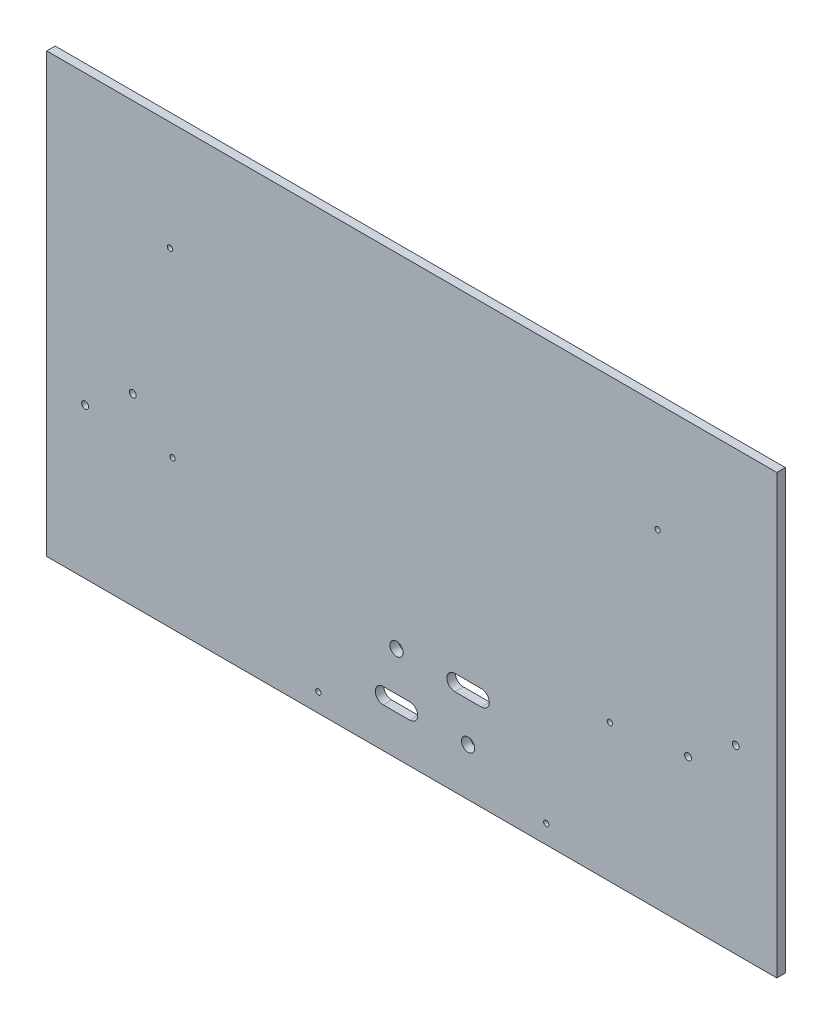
ISO-10303-21;
HEADER;
FILE_DESCRIPTION(('STEP AP214'),'2;1');
FILE_NAME('part.step','',(''),(''),'','','');
FILE_SCHEMA(('AUTOMOTIVE_DESIGN { 1 0 10303 214 1 1 1 1 }'));
ENDSEC;
DATA;
#1=APPLICATION_CONTEXT('core data for automotive mechanical design processes');
#2=APPLICATION_PROTOCOL_DEFINITION('international standard','automotive_design',2000,#1);
#3=PRODUCT_CONTEXT('',#1,'mechanical');
#4=PRODUCT('Part','Part','',(#3));
#5=PRODUCT_RELATED_PRODUCT_CATEGORY('part','',(#4));
#6=PRODUCT_DEFINITION_FORMATION('','',#4);
#7=PRODUCT_DEFINITION_CONTEXT('part definition',#1,'design');
#8=PRODUCT_DEFINITION('design','',#6,#7);
#9=PRODUCT_DEFINITION_SHAPE('','',#8);
#10=(LENGTH_UNIT() NAMED_UNIT(*) SI_UNIT(.MILLI.,.METRE.));
#11=(NAMED_UNIT(*) PLANE_ANGLE_UNIT() SI_UNIT($,.RADIAN.));
#12=(NAMED_UNIT(*) SI_UNIT($,.STERADIAN.) SOLID_ANGLE_UNIT());
#13=UNCERTAINTY_MEASURE_WITH_UNIT(LENGTH_MEASURE(1.E-05),#10,'distance_accuracy_value','');
#14=(GEOMETRIC_REPRESENTATION_CONTEXT(3) GLOBAL_UNCERTAINTY_ASSIGNED_CONTEXT((#13)) GLOBAL_UNIT_ASSIGNED_CONTEXT((#10,
#11,#12)) REPRESENTATION_CONTEXT('',''));
#15=CARTESIAN_POINT('',(0.,0.,0.));
#16=DIRECTION('',(0.,0.,1.));
#17=DIRECTION('',(1.,0.,0.));
#18=AXIS2_PLACEMENT_3D('',#15,#16,#17);
#19=CARTESIAN_POINT('',(0.,0.,1.6));
#20=DIRECTION('',(0.,0.,1.));
#21=DIRECTION('',(1.,0.,0.));
#22=AXIS2_PLACEMENT_3D('',#19,#20,#21);
#23=PLANE('',#22);
#24=CARTESIAN_POINT('',(133.5,-46.,1.6));
#25=DIRECTION('',(0.,0.,-1.));
#26=DIRECTION('',(-1.,0.,0.));
#27=AXIS2_PLACEMENT_3D('',#24,#25,#26);
#28=CIRCLE('',#27,0.5);
#29=CARTESIAN_POINT('',(133.,-46.,1.6));
#30=VERTEX_POINT('',#29);
#31=EDGE_CURVE('E161',#30,#30,#28,.T.);
#32=ORIENTED_EDGE('',*,*,#31,.T.);
#33=EDGE_LOOP('',(#32));
#34=FACE_BOUND('',#33,.T.);
#35=CARTESIAN_POINT('',(148.24899,-73.862798,1.6));
#36=DIRECTION('',(0.,0.,-1.));
#37=DIRECTION('',(-1.,0.,0.));
#38=AXIS2_PLACEMENT_3D('',#35,#36,#37);
#39=CIRCLE('',#38,0.6477);
#40=CARTESIAN_POINT('',(147.60129,-73.862798,1.6));
#41=VERTEX_POINT('',#40);
#42=EDGE_CURVE('E165',#41,#41,#39,.T.);
#43=ORIENTED_EDGE('',*,*,#42,.T.);
#44=EDGE_LOOP('',(#43));
#45=FACE_BOUND('',#44,.T.);
#46=CARTESIAN_POINT('',(41.5,-46.,1.6));
#47=DIRECTION('',(0.,0.,-1.));
#48=DIRECTION('',(-1.,0.,0.));
#49=AXIS2_PLACEMENT_3D('',#46,#47,#48);
#50=CIRCLE('',#49,0.5);
#51=CARTESIAN_POINT('',(41.,-46.,1.6));
#52=VERTEX_POINT('',#51);
#53=EDGE_CURVE('E168',#52,#52,#50,.T.);
#54=ORIENTED_EDGE('',*,*,#53,.T.);
#55=EDGE_LOOP('',(#54));
#56=FACE_BOUND('',#55,.T.);
#57=CARTESIAN_POINT('',(34.5,-73.287202,1.6));
#58=DIRECTION('',(0.,0.,-1.));
#59=DIRECTION('',(-1.,0.,0.));
#60=AXIS2_PLACEMENT_3D('',#57,#58,#59);
#61=CIRCLE('',#60,0.6477);
#62=CARTESIAN_POINT('',(33.8523,-73.287202,1.6));
#63=VERTEX_POINT('',#62);
#64=EDGE_CURVE('E171',#63,#63,#61,.T.);
#65=ORIENTED_EDGE('',*,*,#64,.T.);
#66=EDGE_LOOP('',(#65));
#67=FACE_BOUND('',#66,.T.);
#68=CARTESIAN_POINT('',(139.249008,-80.212798,1.6));
#69=DIRECTION('',(0.,0.,-1.));
#70=DIRECTION('',(-1.,0.,0.));
#71=AXIS2_PLACEMENT_3D('',#68,#69,#70);
#72=CIRCLE('',#71,0.6477);
#73=CARTESIAN_POINT('',(138.601308,-80.212798,1.6));
#74=VERTEX_POINT('',#73);
#75=EDGE_CURVE('E174',#74,#74,#72,.T.);
#76=ORIENTED_EDGE('',*,*,#75,.T.);
#77=EDGE_LOOP('',(#76));
#78=FACE_BOUND('',#77,.T.);
#79=CARTESIAN_POINT('',(124.5,-82.,1.6));
#80=DIRECTION('',(0.,0.,-1.));
#81=DIRECTION('',(-1.,0.,0.));
#82=AXIS2_PLACEMENT_3D('',#79,#80,#81);
#83=CIRCLE('',#82,0.5);
#84=CARTESIAN_POINT('',(124.,-82.,1.6));
#85=VERTEX_POINT('',#84);
#86=EDGE_CURVE('E177',#85,#85,#83,.T.);
#87=ORIENTED_EDGE('',*,*,#86,.T.);
#88=EDGE_LOOP('',(#87));
#89=FACE_BOUND('',#88,.T.);
#90=CARTESIAN_POINT('',(95.25,-90.1,1.6));
#91=DIRECTION('',(0.,0.,-1.));
#92=DIRECTION('',(-1.,0.,0.));
#93=AXIS2_PLACEMENT_3D('',#90,#91,#92);
#94=CIRCLE('',#93,1.5);
#95=CARTESIAN_POINT('',(95.25,-91.6,1.6));
#96=VERTEX_POINT('',#95);
#97=CARTESIAN_POINT('',(95.25,-88.6,1.6));
#98=VERTEX_POINT('',#97);
#99=EDGE_CURVE('E180',#96,#98,#94,.T.);
#100=ORIENTED_EDGE('',*,*,#99,.T.);
#101=DIRECTION('',(1.,0.,0.));
#102=VECTOR('',#101,1.);
#103=CARTESIAN_POINT('',(100.25,-88.6,1.6));
#104=LINE('',#103,#102);
#105=CARTESIAN_POINT('',(100.25,-88.6,1.6));
#106=VERTEX_POINT('',#105);
#107=EDGE_CURVE('E232',#106,#98,#104,.F.);
#108=ORIENTED_EDGE('',*,*,#107,.F.);
#109=CARTESIAN_POINT('',(100.25,-90.1,1.6));
#110=DIRECTION('',(0.,0.,-1.));
#111=DIRECTION('',(-1.,0.,0.));
#112=AXIS2_PLACEMENT_3D('',#109,#110,#111);
#113=CIRCLE('',#112,1.5);
#114=CARTESIAN_POINT('',(100.25,-91.6,1.6));
#115=VERTEX_POINT('',#114);
#116=EDGE_CURVE('E185',#106,#115,#113,.T.);
#117=ORIENTED_EDGE('',*,*,#116,.T.);
#118=DIRECTION('',(1.,0.,0.));
#119=VECTOR('',#118,1.);
#120=CARTESIAN_POINT('',(95.25,-91.6,1.6));
#121=LINE('',#120,#119);
#122=EDGE_CURVE('E110',#96,#115,#121,.T.);
#123=ORIENTED_EDGE('',*,*,#122,.F.);
#124=EDGE_LOOP('',(#100,#108,#117,#123));
#125=FACE_BOUND('',#124,.T.);
#126=CARTESIAN_POINT('',(112.5,-104.5,1.6));
#127=DIRECTION('',(0.,0.,-1.));
#128=DIRECTION('',(-1.,0.,0.));
#129=AXIS2_PLACEMENT_3D('',#126,#127,#128);
#130=CIRCLE('',#129,0.5);
#131=CARTESIAN_POINT('',(112.,-104.5,1.6));
#132=VERTEX_POINT('',#131);
#133=EDGE_CURVE('E188',#132,#132,#130,.T.);
#134=ORIENTED_EDGE('',*,*,#133,.T.);
#135=EDGE_LOOP('',(#134));
#136=FACE_BOUND('',#135,.T.);
#137=CARTESIAN_POINT('',(97.75,-99.,1.6));
#138=DIRECTION('',(0.,0.,-1.));
#139=DIRECTION('',(-1.,0.,0.));
#140=AXIS2_PLACEMENT_3D('',#137,#138,#139);
#141=CIRCLE('',#140,1.25);
#142=CARTESIAN_POINT('',(96.5,-99.,1.6));
#143=VERTEX_POINT('',#142);
#144=EDGE_CURVE('E191',#143,#143,#141,.T.);
#145=ORIENTED_EDGE('',*,*,#144,.T.);
#146=EDGE_LOOP('',(#145));
#147=FACE_BOUND('',#146,.T.);
#148=CARTESIAN_POINT('',(84.25,-90.1,1.6));
#149=DIRECTION('',(0.,0.,-1.));
#150=DIRECTION('',(-1.,0.,0.));
#151=AXIS2_PLACEMENT_3D('',#148,#149,#150);
#152=CIRCLE('',#151,1.25);
#153=CARTESIAN_POINT('',(83.,-90.1,1.6));
#154=VERTEX_POINT('',#153);
#155=EDGE_CURVE('E194',#154,#154,#152,.T.);
#156=ORIENTED_EDGE('',*,*,#155,.T.);
#157=EDGE_LOOP('',(#156));
#158=FACE_BOUND('',#157,.T.);
#159=CARTESIAN_POINT('',(42.,-80.,1.6));
#160=DIRECTION('',(0.,0.,-1.));
#161=DIRECTION('',(-1.,0.,0.));
#162=AXIS2_PLACEMENT_3D('',#159,#160,#161);
#163=CIRCLE('',#162,0.5);
#164=CARTESIAN_POINT('',(41.5,-80.,1.6));
#165=VERTEX_POINT('',#164);
#166=EDGE_CURVE('E197',#165,#165,#163,.T.);
#167=ORIENTED_EDGE('',*,*,#166,.T.);
#168=EDGE_LOOP('',(#167));
#169=FACE_BOUND('',#168,.T.);
#170=CARTESIAN_POINT('',(25.500018,-79.637202,1.6));
#171=DIRECTION('',(0.,0.,-1.));
#172=DIRECTION('',(-1.,0.,0.));
#173=AXIS2_PLACEMENT_3D('',#170,#171,#172);
#174=CIRCLE('',#173,0.6477);
#175=CARTESIAN_POINT('',(24.852318,-79.637202,1.6));
#176=VERTEX_POINT('',#175);
#177=EDGE_CURVE('E106',#176,#176,#174,.T.);
#178=ORIENTED_EDGE('',*,*,#177,.T.);
#179=EDGE_LOOP('',(#178));
#180=FACE_BOUND('',#179,.T.);
#181=CARTESIAN_POINT('',(81.75,-99.,1.6));
#182=DIRECTION('',(0.,0.,-1.));
#183=DIRECTION('',(-1.,0.,0.));
#184=AXIS2_PLACEMENT_3D('',#181,#182,#183);
#185=CIRCLE('',#184,1.5);
#186=CARTESIAN_POINT('',(81.75,-100.5,1.6));
#187=VERTEX_POINT('',#186);
#188=CARTESIAN_POINT('',(81.75,-97.5,1.6));
#189=VERTEX_POINT('',#188);
#190=EDGE_CURVE('E99',#187,#189,#185,.T.);
#191=ORIENTED_EDGE('',*,*,#190,.T.);
#192=DIRECTION('',(1.,0.,0.));
#193=VECTOR('',#192,1.);
#194=CARTESIAN_POINT('',(86.75,-97.5,1.6));
#195=LINE('',#194,#193);
#196=CARTESIAN_POINT('',(86.75,-97.5,1.6));
#197=VERTEX_POINT('',#196);
#198=EDGE_CURVE('E95',#197,#189,#195,.F.);
#199=ORIENTED_EDGE('',*,*,#198,.F.);
#200=CARTESIAN_POINT('',(86.75,-99.,1.6));
#201=DIRECTION('',(0.,0.,-1.));
#202=DIRECTION('',(-1.,0.,0.));
#203=AXIS2_PLACEMENT_3D('',#200,#201,#202);
#204=CIRCLE('',#203,1.5);
#205=CARTESIAN_POINT('',(86.75,-100.5,1.6));
#206=VERTEX_POINT('',#205);
#207=EDGE_CURVE('E83',#197,#206,#204,.T.);
#208=ORIENTED_EDGE('',*,*,#207,.T.);
#209=DIRECTION('',(1.,0.,0.));
#210=VECTOR('',#209,1.);
#211=CARTESIAN_POINT('',(81.75,-100.5,1.6));
#212=LINE('',#211,#210);
#213=EDGE_CURVE('E92',#187,#206,#212,.T.);
#214=ORIENTED_EDGE('',*,*,#213,.F.);
#215=EDGE_LOOP('',(#191,#199,#208,#214));
#216=FACE_BOUND('',#215,.T.);
#217=CARTESIAN_POINT('',(69.5,-104.5,1.6));
#218=DIRECTION('',(0.,0.,-1.));
#219=DIRECTION('',(-1.,0.,0.));
#220=AXIS2_PLACEMENT_3D('',#217,#218,#219);
#221=CIRCLE('',#220,0.5);
#222=CARTESIAN_POINT('',(69.,-104.5,1.6));
#223=VERTEX_POINT('',#222);
#224=EDGE_CURVE('E20',#223,#223,#221,.T.);
#225=ORIENTED_EDGE('',*,*,#224,.T.);
#226=EDGE_LOOP('',(#225));
#227=FACE_BOUND('',#226,.T.);
#228=DIRECTION('',(1.,0.,0.));
#229=VECTOR('',#228,1.);
#230=CARTESIAN_POINT('',(18.25,-25.4,1.6));
#231=LINE('',#230,#229);
#232=CARTESIAN_POINT('',(18.25,-25.4,1.6));
#233=VERTEX_POINT('',#232);
#234=CARTESIAN_POINT('',(156.,-25.4,1.6));
#235=VERTEX_POINT('',#234);
#236=EDGE_CURVE('E221',#233,#235,#231,.T.);
#237=ORIENTED_EDGE('',*,*,#236,.F.);
#238=DIRECTION('',(0.,1.,0.));
#239=VECTOR('',#238,1.);
#240=CARTESIAN_POINT('',(18.25,-108.,1.6));
#241=LINE('',#240,#239);
#242=CARTESIAN_POINT('',(18.25,-108.,1.6));
#243=VERTEX_POINT('',#242);
#244=EDGE_CURVE('E212',#243,#233,#241,.T.);
#245=ORIENTED_EDGE('',*,*,#244,.F.);
#246=DIRECTION('',(1.,0.,0.));
#247=VECTOR('',#246,1.);
#248=CARTESIAN_POINT('',(156.,-108.,1.6));
#249=LINE('',#248,#247);
#250=CARTESIAN_POINT('',(156.,-108.,1.6));
#251=VERTEX_POINT('',#250);
#252=EDGE_CURVE('E230',#251,#243,#249,.F.);
#253=ORIENTED_EDGE('',*,*,#252,.F.);
#254=DIRECTION('',(0.,1.,0.));
#255=VECTOR('',#254,1.);
#256=CARTESIAN_POINT('',(156.,-25.4,1.6));
#257=LINE('',#256,#255);
#258=EDGE_CURVE('E227',#235,#251,#257,.F.);
#259=ORIENTED_EDGE('',*,*,#258,.F.);
#260=EDGE_LOOP('',(#237,#245,#253,#259));
#261=FACE_BOUND('',#260,.T.);
#262=ADVANCED_FACE('F17',(#34,#45,#56,#67,#78,#89,#125,#136,#147,#158,#169,#180,#216,#227,#261),
#23,.T.);
#263=CARTESIAN_POINT('',(156.,-108.,0.));
#264=DIRECTION('',(0.,-1.,0.));
#265=DIRECTION('',(0.,0.,-1.));
#266=AXIS2_PLACEMENT_3D('',#263,#264,#265);
#267=PLANE('',#266);
#268=DIRECTION('',(0.,0.,1.));
#269=VECTOR('',#268,1.);
#270=CARTESIAN_POINT('',(18.25,-108.,0.));
#271=LINE('',#270,#269);
#272=CARTESIAN_POINT('',(18.25,-108.,0.));
#273=VERTEX_POINT('',#272);
#274=EDGE_CURVE('E215',#273,#243,#271,.T.);
#275=ORIENTED_EDGE('',*,*,#274,.F.);
#276=DIRECTION('',(1.,0.,0.));
#277=VECTOR('',#276,1.);
#278=CARTESIAN_POINT('',(0.,-108.,0.));
#279=LINE('',#278,#277);
#280=CARTESIAN_POINT('',(156.,-108.,0.));
#281=VERTEX_POINT('',#280);
#282=EDGE_CURVE('E164',#273,#281,#279,.T.);
#283=ORIENTED_EDGE('',*,*,#282,.T.);
#284=DIRECTION('',(0.,0.,-1.));
#285=VECTOR('',#284,1.);
#286=CARTESIAN_POINT('',(156.,-108.,0.));
#287=LINE('',#286,#285);
#288=EDGE_CURVE('E224',#251,#281,#287,.T.);
#289=ORIENTED_EDGE('',*,*,#288,.F.);
#290=ORIENTED_EDGE('',*,*,#252,.T.);
#291=EDGE_LOOP('',(#275,#283,#289,#290));
#292=FACE_BOUND('',#291,.T.);
#293=ADVANCED_FACE('F275',(#292),#267,.T.);
#294=CARTESIAN_POINT('',(156.,-25.4,0.));
#295=DIRECTION('',(1.,0.,0.));
#296=DIRECTION('',(0.,0.,-1.));
#297=AXIS2_PLACEMENT_3D('',#294,#295,#296);
#298=PLANE('',#297);
#299=ORIENTED_EDGE('',*,*,#288,.T.);
#300=DIRECTION('',(0.,1.,0.));
#301=VECTOR('',#300,1.);
#302=CARTESIAN_POINT('',(156.,0.,0.));
#303=LINE('',#302,#301);
#304=CARTESIAN_POINT('',(156.,-25.4,0.));
#305=VERTEX_POINT('',#304);
#306=EDGE_CURVE('E267',#281,#305,#303,.T.);
#307=ORIENTED_EDGE('',*,*,#306,.T.);
#308=DIRECTION('',(0.,0.,1.));
#309=VECTOR('',#308,1.);
#310=CARTESIAN_POINT('',(156.,-25.4,0.));
#311=LINE('',#310,#309);
#312=EDGE_CURVE('E218',#235,#305,#311,.F.);
#313=ORIENTED_EDGE('',*,*,#312,.F.);
#314=ORIENTED_EDGE('',*,*,#258,.T.);
#315=EDGE_LOOP('',(#299,#307,#313,#314));
#316=FACE_BOUND('',#315,.T.);
#317=ADVANCED_FACE('F296',(#316),#298,.T.);
#318=CARTESIAN_POINT('',(18.25,-25.4,0.));
#319=DIRECTION('',(0.,1.,0.));
#320=DIRECTION('',(0.,0.,1.));
#321=AXIS2_PLACEMENT_3D('',#318,#319,#320);
#322=PLANE('',#321);
#323=ORIENTED_EDGE('',*,*,#312,.T.);
#324=DIRECTION('',(1.,0.,0.));
#325=VECTOR('',#324,1.);
#326=CARTESIAN_POINT('',(0.,-25.4,0.));
#327=LINE('',#326,#325);
#328=CARTESIAN_POINT('',(18.25,-25.4,0.));
#329=VERTEX_POINT('',#328);
#330=EDGE_CURVE('E264',#305,#329,#327,.F.);
#331=ORIENTED_EDGE('',*,*,#330,.T.);
#332=DIRECTION('',(0.,0.,1.));
#333=VECTOR('',#332,1.);
#334=CARTESIAN_POINT('',(18.25,-25.4,0.));
#335=LINE('',#334,#333);
#336=EDGE_CURVE('E209',#233,#329,#335,.F.);
#337=ORIENTED_EDGE('',*,*,#336,.F.);
#338=ORIENTED_EDGE('',*,*,#236,.T.);
#339=EDGE_LOOP('',(#323,#331,#337,#338));
#340=FACE_BOUND('',#339,.T.);
#341=ADVANCED_FACE('F304',(#340),#322,.T.);
#342=CARTESIAN_POINT('',(18.25,-108.,0.));
#343=DIRECTION('',(-1.,0.,0.));
#344=DIRECTION('',(0.,0.,1.));
#345=AXIS2_PLACEMENT_3D('',#342,#343,#344);
#346=PLANE('',#345);
#347=ORIENTED_EDGE('',*,*,#336,.T.);
#348=DIRECTION('',(0.,1.,0.));
#349=VECTOR('',#348,1.);
#350=CARTESIAN_POINT('',(18.25,0.,0.));
#351=LINE('',#350,#349);
#352=EDGE_CURVE('E160',#329,#273,#351,.F.);
#353=ORIENTED_EDGE('',*,*,#352,.T.);
#354=ORIENTED_EDGE('',*,*,#274,.T.);
#355=ORIENTED_EDGE('',*,*,#244,.T.);
#356=EDGE_LOOP('',(#347,#353,#354,#355));
#357=FACE_BOUND('',#356,.T.);
#358=ADVANCED_FACE('F301',(#357),#346,.T.);
#359=CARTESIAN_POINT('',(69.5,-104.5,-0.045));
#360=DIRECTION('',(0.,0.,-1.));
#361=DIRECTION('',(-1.,0.,0.));
#362=AXIS2_PLACEMENT_3D('',#359,#360,#361);
#363=CYLINDRICAL_SURFACE('',#362,0.5);
#364=ORIENTED_EDGE('',*,*,#224,.F.);
#365=EDGE_LOOP('',(#364));
#366=FACE_BOUND('',#365,.T.);
#367=CARTESIAN_POINT('',(69.5,-104.5,0.));
#368=DIRECTION('',(0.,0.,-1.));
#369=DIRECTION('',(-1.,0.,0.));
#370=AXIS2_PLACEMENT_3D('',#367,#368,#369);
#371=CIRCLE('',#370,0.5);
#372=CARTESIAN_POINT('',(69.,-104.5,0.));
#373=VERTEX_POINT('',#372);
#374=EDGE_CURVE('E157',#373,#373,#371,.T.);
#375=ORIENTED_EDGE('',*,*,#374,.T.);
#376=EDGE_LOOP('',(#375));
#377=FACE_BOUND('',#376,.T.);
#378=ADVANCED_FACE('F312',(#366,#377),#363,.F.);
#379=CARTESIAN_POINT('',(86.75,-99.,-0.045));
#380=DIRECTION('',(0.,0.,-1.));
#381=DIRECTION('',(-1.,0.,0.));
#382=AXIS2_PLACEMENT_3D('',#379,#380,#381);
#383=CYLINDRICAL_SURFACE('',#382,1.5);
#384=DIRECTION('',(0.,0.,1.));
#385=VECTOR('',#384,1.);
#386=CARTESIAN_POINT('',(86.75,-100.5,-0.045));
#387=LINE('',#386,#385);
#388=CARTESIAN_POINT('',(86.75,-100.5,0.));
#389=VERTEX_POINT('',#388);
#390=EDGE_CURVE('E89',#206,#389,#387,.F.);
#391=ORIENTED_EDGE('',*,*,#390,.F.);
#392=ORIENTED_EDGE('',*,*,#207,.F.);
#393=DIRECTION('',(0.,0.,-1.));
#394=VECTOR('',#393,1.);
#395=CARTESIAN_POINT('',(86.75,-97.5,-0.045));
#396=LINE('',#395,#394);
#397=CARTESIAN_POINT('',(86.75,-97.5,0.));
#398=VERTEX_POINT('',#397);
#399=EDGE_CURVE('E87',#398,#197,#396,.F.);
#400=ORIENTED_EDGE('',*,*,#399,.F.);
#401=CARTESIAN_POINT('',(86.75,-99.,0.));
#402=DIRECTION('',(0.,0.,-1.));
#403=DIRECTION('',(-1.,0.,0.));
#404=AXIS2_PLACEMENT_3D('',#401,#402,#403);
#405=CIRCLE('',#404,1.5);
#406=EDGE_CURVE('E155',#398,#389,#405,.T.);
#407=ORIENTED_EDGE('',*,*,#406,.T.);
#408=EDGE_LOOP('',(#391,#392,#400,#407));
#409=FACE_BOUND('',#408,.T.);
#410=ADVANCED_FACE('F85',(#409),#383,.F.);
#411=CARTESIAN_POINT('',(81.75,-100.5,-0.045));
#412=DIRECTION('',(0.,1.,0.));
#413=DIRECTION('',(0.,0.,1.));
#414=AXIS2_PLACEMENT_3D('',#411,#412,#413);
#415=PLANE('',#414);
#416=ORIENTED_EDGE('',*,*,#213,.T.);
#417=ORIENTED_EDGE('',*,*,#390,.T.);
#418=DIRECTION('',(1.,0.,0.));
#419=VECTOR('',#418,1.);
#420=CARTESIAN_POINT('',(0.,-100.5,0.));
#421=LINE('',#420,#419);
#422=CARTESIAN_POINT('',(81.75,-100.5,0.));
#423=VERTEX_POINT('',#422);
#424=EDGE_CURVE('E154',#389,#423,#421,.F.);
#425=ORIENTED_EDGE('',*,*,#424,.T.);
#426=DIRECTION('',(0.,0.,-1.));
#427=VECTOR('',#426,1.);
#428=CARTESIAN_POINT('',(81.75,-100.5,-0.045));
#429=LINE('',#428,#427);
#430=EDGE_CURVE('E202',#423,#187,#429,.F.);
#431=ORIENTED_EDGE('',*,*,#430,.T.);
#432=EDGE_LOOP('',(#416,#417,#425,#431));
#433=FACE_BOUND('',#432,.T.);
#434=ADVANCED_FACE('F383',(#433),#415,.T.);
#435=CARTESIAN_POINT('',(81.75,-99.,-0.045));
#436=DIRECTION('',(0.,0.,-1.));
#437=DIRECTION('',(-1.,0.,0.));
#438=AXIS2_PLACEMENT_3D('',#435,#436,#437);
#439=CYLINDRICAL_SURFACE('',#438,1.5);
#440=DIRECTION('',(0.,0.,-1.));
#441=VECTOR('',#440,1.);
#442=CARTESIAN_POINT('',(81.75,-97.5,-0.045));
#443=LINE('',#442,#441);
#444=CARTESIAN_POINT('',(81.75,-97.5,0.));
#445=VERTEX_POINT('',#444);
#446=EDGE_CURVE('E104',#189,#445,#443,.T.);
#447=ORIENTED_EDGE('',*,*,#446,.F.);
#448=ORIENTED_EDGE('',*,*,#190,.F.);
#449=ORIENTED_EDGE('',*,*,#430,.F.);
#450=CARTESIAN_POINT('',(81.75,-99.,0.));
#451=DIRECTION('',(0.,0.,-1.));
#452=DIRECTION('',(-1.,0.,0.));
#453=AXIS2_PLACEMENT_3D('',#450,#451,#452);
#454=CIRCLE('',#453,1.5);
#455=EDGE_CURVE('E151',#423,#445,#454,.T.);
#456=ORIENTED_EDGE('',*,*,#455,.T.);
#457=EDGE_LOOP('',(#447,#448,#449,#456));
#458=FACE_BOUND('',#457,.T.);
#459=ADVANCED_FACE('F380',(#458),#439,.F.);
#460=CARTESIAN_POINT('',(86.75,-97.5,-0.045));
#461=DIRECTION('',(0.,-1.,0.));
#462=DIRECTION('',(0.,0.,-1.));
#463=AXIS2_PLACEMENT_3D('',#460,#461,#462);
#464=PLANE('',#463);
#465=ORIENTED_EDGE('',*,*,#198,.T.);
#466=ORIENTED_EDGE('',*,*,#446,.T.);
#467=DIRECTION('',(1.,0.,0.));
#468=VECTOR('',#467,1.);
#469=CARTESIAN_POINT('',(0.,-97.5,0.));
#470=LINE('',#469,#468);
#471=EDGE_CURVE('E98',#445,#398,#470,.T.);
#472=ORIENTED_EDGE('',*,*,#471,.T.);
#473=ORIENTED_EDGE('',*,*,#399,.T.);
#474=EDGE_LOOP('',(#465,#466,#472,#473));
#475=FACE_BOUND('',#474,.T.);
#476=ADVANCED_FACE('F94',(#475),#464,.T.);
#477=CARTESIAN_POINT('',(25.500018,-79.637202,-0.045));
#478=DIRECTION('',(0.,0.,-1.));
#479=DIRECTION('',(-1.,0.,0.));
#480=AXIS2_PLACEMENT_3D('',#477,#478,#479);
#481=CYLINDRICAL_SURFACE('',#480,0.6477);
#482=ORIENTED_EDGE('',*,*,#177,.F.);
#483=EDGE_LOOP('',(#482));
#484=FACE_BOUND('',#483,.T.);
#485=CARTESIAN_POINT('',(25.500018,-79.637202,0.));
#486=DIRECTION('',(0.,0.,-1.));
#487=DIRECTION('',(-1.,0.,0.));
#488=AXIS2_PLACEMENT_3D('',#485,#486,#487);
#489=CIRCLE('',#488,0.6477);
#490=CARTESIAN_POINT('',(24.852318,-79.637202,0.));
#491=VERTEX_POINT('',#490);
#492=EDGE_CURVE('E148',#491,#491,#489,.T.);
#493=ORIENTED_EDGE('',*,*,#492,.T.);
#494=EDGE_LOOP('',(#493));
#495=FACE_BOUND('',#494,.T.);
#496=ADVANCED_FACE('F373',(#484,#495),#481,.F.);
#497=CARTESIAN_POINT('',(42.,-80.,-0.045));
#498=DIRECTION('',(0.,0.,-1.));
#499=DIRECTION('',(-1.,0.,0.));
#500=AXIS2_PLACEMENT_3D('',#497,#498,#499);
#501=CYLINDRICAL_SURFACE('',#500,0.5);
#502=ORIENTED_EDGE('',*,*,#166,.F.);
#503=EDGE_LOOP('',(#502));
#504=FACE_BOUND('',#503,.T.);
#505=CARTESIAN_POINT('',(42.,-80.,0.));
#506=DIRECTION('',(0.,0.,-1.));
#507=DIRECTION('',(-1.,0.,0.));
#508=AXIS2_PLACEMENT_3D('',#505,#506,#507);
#509=CIRCLE('',#508,0.5);
#510=CARTESIAN_POINT('',(41.5,-80.,0.));
#511=VERTEX_POINT('',#510);
#512=EDGE_CURVE('E145',#511,#511,#509,.T.);
#513=ORIENTED_EDGE('',*,*,#512,.T.);
#514=EDGE_LOOP('',(#513));
#515=FACE_BOUND('',#514,.T.);
#516=ADVANCED_FACE('F369',(#504,#515),#501,.F.);
#517=CARTESIAN_POINT('',(84.25,-90.1,-0.045));
#518=DIRECTION('',(0.,0.,-1.));
#519=DIRECTION('',(-1.,0.,0.));
#520=AXIS2_PLACEMENT_3D('',#517,#518,#519);
#521=CYLINDRICAL_SURFACE('',#520,1.25);
#522=ORIENTED_EDGE('',*,*,#155,.F.);
#523=EDGE_LOOP('',(#522));
#524=FACE_BOUND('',#523,.T.);
#525=CARTESIAN_POINT('',(84.25,-90.1,0.));
#526=DIRECTION('',(0.,0.,-1.));
#527=DIRECTION('',(-1.,0.,0.));
#528=AXIS2_PLACEMENT_3D('',#525,#526,#527);
#529=CIRCLE('',#528,1.25);
#530=CARTESIAN_POINT('',(83.,-90.1,0.));
#531=VERTEX_POINT('',#530);
#532=EDGE_CURVE('E142',#531,#531,#529,.T.);
#533=ORIENTED_EDGE('',*,*,#532,.T.);
#534=EDGE_LOOP('',(#533));
#535=FACE_BOUND('',#534,.T.);
#536=ADVANCED_FACE('F365',(#524,#535),#521,.F.);
#537=CARTESIAN_POINT('',(97.75,-99.,-0.045));
#538=DIRECTION('',(0.,0.,-1.));
#539=DIRECTION('',(-1.,0.,0.));
#540=AXIS2_PLACEMENT_3D('',#537,#538,#539);
#541=CYLINDRICAL_SURFACE('',#540,1.25);
#542=ORIENTED_EDGE('',*,*,#144,.F.);
#543=EDGE_LOOP('',(#542));
#544=FACE_BOUND('',#543,.T.);
#545=CARTESIAN_POINT('',(97.75,-99.,0.));
#546=DIRECTION('',(0.,0.,-1.));
#547=DIRECTION('',(-1.,0.,0.));
#548=AXIS2_PLACEMENT_3D('',#545,#546,#547);
#549=CIRCLE('',#548,1.25);
#550=CARTESIAN_POINT('',(96.5,-99.,0.));
#551=VERTEX_POINT('',#550);
#552=EDGE_CURVE('E139',#551,#551,#549,.T.);
#553=ORIENTED_EDGE('',*,*,#552,.T.);
#554=EDGE_LOOP('',(#553));
#555=FACE_BOUND('',#554,.T.);
#556=ADVANCED_FACE('F361',(#544,#555),#541,.F.);
#557=CARTESIAN_POINT('',(112.5,-104.5,-0.045));
#558=DIRECTION('',(0.,0.,-1.));
#559=DIRECTION('',(-1.,0.,0.));
#560=AXIS2_PLACEMENT_3D('',#557,#558,#559);
#561=CYLINDRICAL_SURFACE('',#560,0.5);
#562=ORIENTED_EDGE('',*,*,#133,.F.);
#563=EDGE_LOOP('',(#562));
#564=FACE_BOUND('',#563,.T.);
#565=CARTESIAN_POINT('',(112.5,-104.5,0.));
#566=DIRECTION('',(0.,0.,-1.));
#567=DIRECTION('',(-1.,0.,0.));
#568=AXIS2_PLACEMENT_3D('',#565,#566,#567);
#569=CIRCLE('',#568,0.5);
#570=CARTESIAN_POINT('',(112.,-104.5,0.));
#571=VERTEX_POINT('',#570);
#572=EDGE_CURVE('E136',#571,#571,#569,.T.);
#573=ORIENTED_EDGE('',*,*,#572,.T.);
#574=EDGE_LOOP('',(#573));
#575=FACE_BOUND('',#574,.T.);
#576=ADVANCED_FACE('F358',(#564,#575),#561,.F.);
#577=CARTESIAN_POINT('',(100.25,-90.1,-0.045));
#578=DIRECTION('',(0.,0.,-1.));
#579=DIRECTION('',(-1.,0.,0.));
#580=AXIS2_PLACEMENT_3D('',#577,#578,#579);
#581=CYLINDRICAL_SURFACE('',#580,1.5);
#582=DIRECTION('',(0.,0.,1.));
#583=VECTOR('',#582,1.);
#584=CARTESIAN_POINT('',(100.25,-91.6,-0.045));
#585=LINE('',#584,#583);
#586=CARTESIAN_POINT('',(100.25,-91.6,0.));
#587=VERTEX_POINT('',#586);
#588=EDGE_CURVE('E242',#115,#587,#585,.F.);
#589=ORIENTED_EDGE('',*,*,#588,.F.);
#590=ORIENTED_EDGE('',*,*,#116,.F.);
#591=DIRECTION('',(0.,0.,-1.));
#592=VECTOR('',#591,1.);
#593=CARTESIAN_POINT('',(100.25,-88.6,-0.045));
#594=LINE('',#593,#592);
#595=CARTESIAN_POINT('',(100.25,-88.6,0.));
#596=VERTEX_POINT('',#595);
#597=EDGE_CURVE('E183',#596,#106,#594,.F.);
#598=ORIENTED_EDGE('',*,*,#597,.F.);
#599=CARTESIAN_POINT('',(100.25,-90.1,0.));
#600=DIRECTION('',(0.,0.,-1.));
#601=DIRECTION('',(-1.,0.,0.));
#602=AXIS2_PLACEMENT_3D('',#599,#600,#601);
#603=CIRCLE('',#602,1.5);
#604=EDGE_CURVE('E133',#596,#587,#603,.T.);
#605=ORIENTED_EDGE('',*,*,#604,.T.);
#606=EDGE_LOOP('',(#589,#590,#598,#605));
#607=FACE_BOUND('',#606,.T.);
#608=ADVANCED_FACE('F252',(#607),#581,.F.);
#609=CARTESIAN_POINT('',(95.25,-91.6,-0.045));
#610=DIRECTION('',(0.,1.,0.));
#611=DIRECTION('',(0.,0.,1.));
#612=AXIS2_PLACEMENT_3D('',#609,#610,#611);
#613=PLANE('',#612);
#614=ORIENTED_EDGE('',*,*,#122,.T.);
#615=ORIENTED_EDGE('',*,*,#588,.T.);
#616=DIRECTION('',(1.,0.,0.));
#617=VECTOR('',#616,1.);
#618=CARTESIAN_POINT('',(0.,-91.6,0.));
#619=LINE('',#618,#617);
#620=CARTESIAN_POINT('',(95.25,-91.6,0.));
#621=VERTEX_POINT('',#620);
#622=EDGE_CURVE('E132',#587,#621,#619,.F.);
#623=ORIENTED_EDGE('',*,*,#622,.T.);
#624=DIRECTION('',(0.,0.,-1.));
#625=VECTOR('',#624,1.);
#626=CARTESIAN_POINT('',(95.25,-91.6,-0.045));
#627=LINE('',#626,#625);
#628=EDGE_CURVE('E184',#621,#96,#627,.F.);
#629=ORIENTED_EDGE('',*,*,#628,.T.);
#630=EDGE_LOOP('',(#614,#615,#623,#629));
#631=FACE_BOUND('',#630,.T.);
#632=ADVANCED_FACE('F247',(#631),#613,.T.);
#633=CARTESIAN_POINT('',(95.25,-90.1,-0.045));
#634=DIRECTION('',(0.,0.,-1.));
#635=DIRECTION('',(-1.,0.,0.));
#636=AXIS2_PLACEMENT_3D('',#633,#634,#635);
#637=CYLINDRICAL_SURFACE('',#636,1.5);
#638=DIRECTION('',(0.,0.,-1.));
#639=VECTOR('',#638,1.);
#640=CARTESIAN_POINT('',(95.25,-88.6,-0.045));
#641=LINE('',#640,#639);
#642=CARTESIAN_POINT('',(95.25,-88.6,0.));
#643=VERTEX_POINT('',#642);
#644=EDGE_CURVE('E35',#98,#643,#641,.T.);
#645=ORIENTED_EDGE('',*,*,#644,.F.);
#646=ORIENTED_EDGE('',*,*,#99,.F.);
#647=ORIENTED_EDGE('',*,*,#628,.F.);
#648=CARTESIAN_POINT('',(95.25,-90.1,0.));
#649=DIRECTION('',(0.,0.,-1.));
#650=DIRECTION('',(-1.,0.,0.));
#651=AXIS2_PLACEMENT_3D('',#648,#649,#650);
#652=CIRCLE('',#651,1.5);
#653=EDGE_CURVE('E129',#621,#643,#652,.T.);
#654=ORIENTED_EDGE('',*,*,#653,.T.);
#655=EDGE_LOOP('',(#645,#646,#647,#654));
#656=FACE_BOUND('',#655,.T.);
#657=ADVANCED_FACE('F350',(#656),#637,.F.);
#658=CARTESIAN_POINT('',(100.25,-88.6,-0.045));
#659=DIRECTION('',(0.,-1.,0.));
#660=DIRECTION('',(0.,0.,-1.));
#661=AXIS2_PLACEMENT_3D('',#658,#659,#660);
#662=PLANE('',#661);
#663=ORIENTED_EDGE('',*,*,#107,.T.);
#664=ORIENTED_EDGE('',*,*,#644,.T.);
#665=DIRECTION('',(1.,0.,0.));
#666=VECTOR('',#665,1.);
#667=CARTESIAN_POINT('',(0.,-88.6,0.));
#668=LINE('',#667,#666);
#669=EDGE_CURVE('E128',#643,#596,#668,.T.);
#670=ORIENTED_EDGE('',*,*,#669,.T.);
#671=ORIENTED_EDGE('',*,*,#597,.T.);
#672=EDGE_LOOP('',(#663,#664,#670,#671));
#673=FACE_BOUND('',#672,.T.);
#674=ADVANCED_FACE('F346',(#673),#662,.T.);
#675=CARTESIAN_POINT('',(124.5,-82.,-0.045));
#676=DIRECTION('',(0.,0.,-1.));
#677=DIRECTION('',(-1.,0.,0.));
#678=AXIS2_PLACEMENT_3D('',#675,#676,#677);
#679=CYLINDRICAL_SURFACE('',#678,0.5);
#680=ORIENTED_EDGE('',*,*,#86,.F.);
#681=EDGE_LOOP('',(#680));
#682=FACE_BOUND('',#681,.T.);
#683=CARTESIAN_POINT('',(124.5,-82.,0.));
#684=DIRECTION('',(0.,0.,-1.));
#685=DIRECTION('',(-1.,0.,0.));
#686=AXIS2_PLACEMENT_3D('',#683,#684,#685);
#687=CIRCLE('',#686,0.5);
#688=CARTESIAN_POINT('',(124.,-82.,0.));
#689=VERTEX_POINT('',#688);
#690=EDGE_CURVE('E125',#689,#689,#687,.T.);
#691=ORIENTED_EDGE('',*,*,#690,.T.);
#692=EDGE_LOOP('',(#691));
#693=FACE_BOUND('',#692,.T.);
#694=ADVANCED_FACE('F342',(#682,#693),#679,.F.);
#695=CARTESIAN_POINT('',(139.249008,-80.212798,-0.045));
#696=DIRECTION('',(0.,0.,-1.));
#697=DIRECTION('',(-1.,0.,0.));
#698=AXIS2_PLACEMENT_3D('',#695,#696,#697);
#699=CYLINDRICAL_SURFACE('',#698,0.6477);
#700=ORIENTED_EDGE('',*,*,#75,.F.);
#701=EDGE_LOOP('',(#700));
#702=FACE_BOUND('',#701,.T.);
#703=CARTESIAN_POINT('',(139.249008,-80.212798,0.));
#704=DIRECTION('',(0.,0.,-1.));
#705=DIRECTION('',(-1.,0.,0.));
#706=AXIS2_PLACEMENT_3D('',#703,#704,#705);
#707=CIRCLE('',#706,0.6477);
#708=CARTESIAN_POINT('',(138.601308,-80.212798,0.));
#709=VERTEX_POINT('',#708);
#710=EDGE_CURVE('E122',#709,#709,#707,.T.);
#711=ORIENTED_EDGE('',*,*,#710,.T.);
#712=EDGE_LOOP('',(#711));
#713=FACE_BOUND('',#712,.T.);
#714=ADVANCED_FACE('F338',(#702,#713),#699,.F.);
#715=CARTESIAN_POINT('',(34.5,-73.287202,-0.045));
#716=DIRECTION('',(0.,0.,-1.));
#717=DIRECTION('',(-1.,0.,0.));
#718=AXIS2_PLACEMENT_3D('',#715,#716,#717);
#719=CYLINDRICAL_SURFACE('',#718,0.6477);
#720=ORIENTED_EDGE('',*,*,#64,.F.);
#721=EDGE_LOOP('',(#720));
#722=FACE_BOUND('',#721,.T.);
#723=CARTESIAN_POINT('',(34.5,-73.287202,0.));
#724=DIRECTION('',(0.,0.,-1.));
#725=DIRECTION('',(-1.,0.,0.));
#726=AXIS2_PLACEMENT_3D('',#723,#724,#725);
#727=CIRCLE('',#726,0.6477);
#728=CARTESIAN_POINT('',(33.8523,-73.287202,0.));
#729=VERTEX_POINT('',#728);
#730=EDGE_CURVE('E119',#729,#729,#727,.T.);
#731=ORIENTED_EDGE('',*,*,#730,.T.);
#732=EDGE_LOOP('',(#731));
#733=FACE_BOUND('',#732,.T.);
#734=ADVANCED_FACE('F334',(#722,#733),#719,.F.);
#735=CARTESIAN_POINT('',(41.5,-46.,-0.045));
#736=DIRECTION('',(0.,0.,-1.));
#737=DIRECTION('',(-1.,0.,0.));
#738=AXIS2_PLACEMENT_3D('',#735,#736,#737);
#739=CYLINDRICAL_SURFACE('',#738,0.5);
#740=ORIENTED_EDGE('',*,*,#53,.F.);
#741=EDGE_LOOP('',(#740));
#742=FACE_BOUND('',#741,.T.);
#743=CARTESIAN_POINT('',(41.5,-46.,0.));
#744=DIRECTION('',(0.,0.,-1.));
#745=DIRECTION('',(-1.,0.,0.));
#746=AXIS2_PLACEMENT_3D('',#743,#744,#745);
#747=CIRCLE('',#746,0.5);
#748=CARTESIAN_POINT('',(41.,-46.,0.));
#749=VERTEX_POINT('',#748);
#750=EDGE_CURVE('E116',#749,#749,#747,.T.);
#751=ORIENTED_EDGE('',*,*,#750,.T.);
#752=EDGE_LOOP('',(#751));
#753=FACE_BOUND('',#752,.T.);
#754=ADVANCED_FACE('F330',(#742,#753),#739,.F.);
#755=CARTESIAN_POINT('',(148.24899,-73.862798,-0.045));
#756=DIRECTION('',(0.,0.,-1.));
#757=DIRECTION('',(-1.,0.,0.));
#758=AXIS2_PLACEMENT_3D('',#755,#756,#757);
#759=CYLINDRICAL_SURFACE('',#758,0.6477);
#760=ORIENTED_EDGE('',*,*,#42,.F.);
#761=EDGE_LOOP('',(#760));
#762=FACE_BOUND('',#761,.T.);
#763=CARTESIAN_POINT('',(148.24899,-73.862798,0.));
#764=DIRECTION('',(0.,0.,-1.));
#765=DIRECTION('',(-1.,0.,0.));
#766=AXIS2_PLACEMENT_3D('',#763,#764,#765);
#767=CIRCLE('',#766,0.6477);
#768=CARTESIAN_POINT('',(147.60129,-73.862798,0.));
#769=VERTEX_POINT('',#768);
#770=EDGE_CURVE('E26',#769,#769,#767,.T.);
#771=ORIENTED_EDGE('',*,*,#770,.T.);
#772=EDGE_LOOP('',(#771));
#773=FACE_BOUND('',#772,.T.);
#774=ADVANCED_FACE('F322',(#762,#773),#759,.F.);
#775=CARTESIAN_POINT('',(133.5,-46.,-0.045));
#776=DIRECTION('',(0.,0.,-1.));
#777=DIRECTION('',(-1.,0.,0.));
#778=AXIS2_PLACEMENT_3D('',#775,#776,#777);
#779=CYLINDRICAL_SURFACE('',#778,0.5);
#780=ORIENTED_EDGE('',*,*,#31,.F.);
#781=EDGE_LOOP('',(#780));
#782=FACE_BOUND('',#781,.T.);
#783=CARTESIAN_POINT('',(133.5,-46.,0.));
#784=DIRECTION('',(0.,0.,-1.));
#785=DIRECTION('',(-1.,0.,0.));
#786=AXIS2_PLACEMENT_3D('',#783,#784,#785);
#787=CIRCLE('',#786,0.5);
#788=CARTESIAN_POINT('',(133.,-46.,0.));
#789=VERTEX_POINT('',#788);
#790=EDGE_CURVE('E11',#789,#789,#787,.T.);
#791=ORIENTED_EDGE('',*,*,#790,.T.);
#792=EDGE_LOOP('',(#791));
#793=FACE_BOUND('',#792,.T.);
#794=ADVANCED_FACE('F316',(#782,#793),#779,.F.);
#795=CARTESIAN_POINT('',(0.,0.,0.));
#796=DIRECTION('',(0.,0.,1.));
#797=DIRECTION('',(1.,0.,0.));
#798=AXIS2_PLACEMENT_3D('',#795,#796,#797);
#799=PLANE('',#798);
#800=ORIENTED_EDGE('',*,*,#790,.F.);
#801=EDGE_LOOP('',(#800));
#802=FACE_BOUND('',#801,.T.);
#803=ORIENTED_EDGE('',*,*,#770,.F.);
#804=EDGE_LOOP('',(#803));
#805=FACE_BOUND('',#804,.T.);
#806=ORIENTED_EDGE('',*,*,#750,.F.);
#807=EDGE_LOOP('',(#806));
#808=FACE_BOUND('',#807,.T.);
#809=ORIENTED_EDGE('',*,*,#730,.F.);
#810=EDGE_LOOP('',(#809));
#811=FACE_BOUND('',#810,.T.);
#812=ORIENTED_EDGE('',*,*,#710,.F.);
#813=EDGE_LOOP('',(#812));
#814=FACE_BOUND('',#813,.T.);
#815=ORIENTED_EDGE('',*,*,#690,.F.);
#816=EDGE_LOOP('',(#815));
#817=FACE_BOUND('',#816,.T.);
#818=ORIENTED_EDGE('',*,*,#653,.F.);
#819=ORIENTED_EDGE('',*,*,#622,.F.);
#820=ORIENTED_EDGE('',*,*,#604,.F.);
#821=ORIENTED_EDGE('',*,*,#669,.F.);
#822=EDGE_LOOP('',(#818,#819,#820,#821));
#823=FACE_BOUND('',#822,.T.);
#824=ORIENTED_EDGE('',*,*,#572,.F.);
#825=EDGE_LOOP('',(#824));
#826=FACE_BOUND('',#825,.T.);
#827=ORIENTED_EDGE('',*,*,#552,.F.);
#828=EDGE_LOOP('',(#827));
#829=FACE_BOUND('',#828,.T.);
#830=ORIENTED_EDGE('',*,*,#532,.F.);
#831=EDGE_LOOP('',(#830));
#832=FACE_BOUND('',#831,.T.);
#833=ORIENTED_EDGE('',*,*,#512,.F.);
#834=EDGE_LOOP('',(#833));
#835=FACE_BOUND('',#834,.T.);
#836=ORIENTED_EDGE('',*,*,#492,.F.);
#837=EDGE_LOOP('',(#836));
#838=FACE_BOUND('',#837,.T.);
#839=ORIENTED_EDGE('',*,*,#455,.F.);
#840=ORIENTED_EDGE('',*,*,#424,.F.);
#841=ORIENTED_EDGE('',*,*,#406,.F.);
#842=ORIENTED_EDGE('',*,*,#471,.F.);
#843=EDGE_LOOP('',(#839,#840,#841,#842));
#844=FACE_BOUND('',#843,.T.);
#845=ORIENTED_EDGE('',*,*,#374,.F.);
#846=EDGE_LOOP('',(#845));
#847=FACE_BOUND('',#846,.T.);
#848=ORIENTED_EDGE('',*,*,#330,.F.);
#849=ORIENTED_EDGE('',*,*,#306,.F.);
#850=ORIENTED_EDGE('',*,*,#282,.F.);
#851=ORIENTED_EDGE('',*,*,#352,.F.);
#852=EDGE_LOOP('',(#848,#849,#850,#851));
#853=FACE_BOUND('',#852,.T.);
#854=ADVANCED_FACE('F255',(#802,#805,#808,#811,#814,#817,#823,#826,#829,#832,#835,#838,#844,
#847,#853),#799,.F.);
#855=CLOSED_SHELL('',(#262,#293,#317,#341,#358,#378,#410,#434,#459,#476,#496,#516,#536,#556,
#576,#608,#632,#657,#674,#694,#714,#734,#754,#774,#794,#854));
#856=MANIFOLD_SOLID_BREP('B1',#855);
#857=ADVANCED_BREP_SHAPE_REPRESENTATION('',(#18,#856),#14);
#858=SHAPE_DEFINITION_REPRESENTATION(#9,#857);
ENDSEC;
END-ISO-10303-21;
